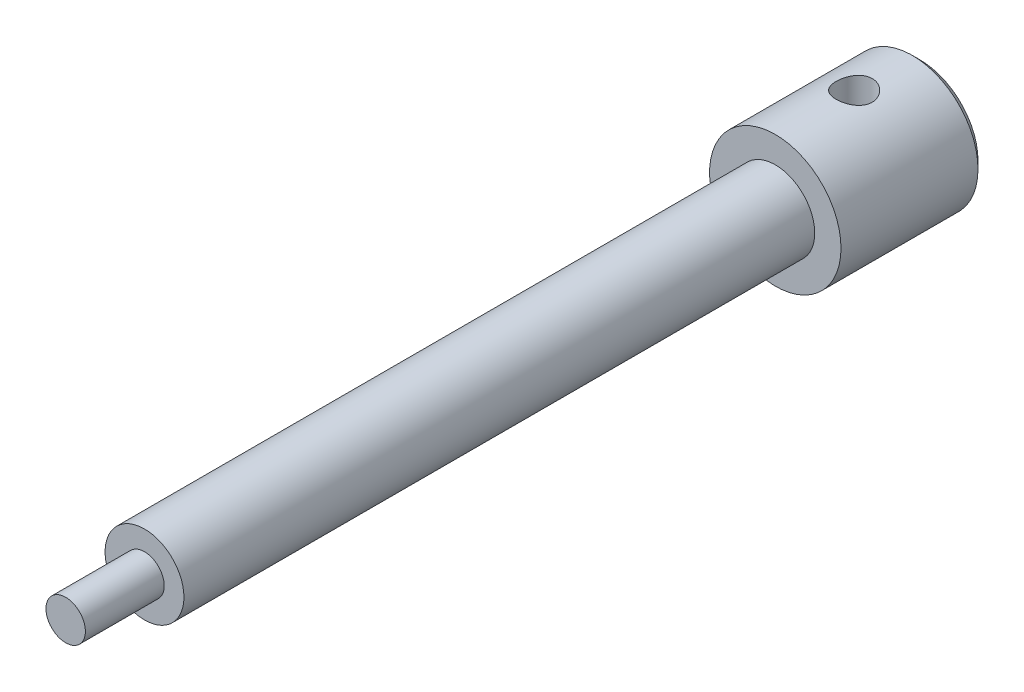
from build123d import *

# Parameters (mm, degrees)
SKETCH2_R               = 10
BOSS_EXTRUDE1_DEPTH     = 22
SKETCH3_R               = 6
BOSS_EXTRUDE2_DEPTH     = 96
SKETCH4_R               = 3
BOSS_EXTRUDE3_DEPTH     = 12
CUT_EXTRUDE1_DEPTH      = 109.921990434
CUT_EXTRUDE1_DEPTH_BACK = 109.921990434
SKETCH5_R               = 2.75
CHAMFER1_SIZE           = 1.15


with BuildPart() as part:
    # Sketch2 → Boss-Extrude1 (new body)
    with BuildSketch(Plane.XY):
        Circle(SKETCH2_R)
    extrude(amount=-BOSS_EXTRUDE1_DEPTH)

    # Sketch3 → Boss-Extrude2 (add)
    with BuildSketch(Plane.XY):
        Circle(SKETCH3_R)
    extrude(amount=BOSS_EXTRUDE2_DEPTH)

    # Sketch4 → Boss-Extrude3 (add)
    with BuildSketch(Plane.XY.offset(96)):
        Circle(SKETCH4_R)
    extrude(amount=BOSS_EXTRUDE3_DEPTH)

    # Sketch5 → Cut-Extrude1 (cut, two sides: drawn at the far end of the back side and taken through both)
    with BuildSketch(Plane(origin=(0, 0, 0), x_dir=(1, 0, 0), z_dir=(0, 1, 0)).offset(-CUT_EXTRUDE1_DEPTH_BACK)):
        with Locations(Location((0, 12, 0), (0, 0, 270))):
            Circle(SKETCH5_R)
    extrude(amount=CUT_EXTRUDE1_DEPTH + CUT_EXTRUDE1_DEPTH_BACK, mode=Mode.SUBTRACT)

    # Chamfer1
    chamfer1_edges = [part.edges().sort_by_distance(p)[0] for p in [
        (-10, 0, -22),
    ]]
    chamfer(chamfer1_edges, length=CHAMFER1_SIZE)


solid = part.part
